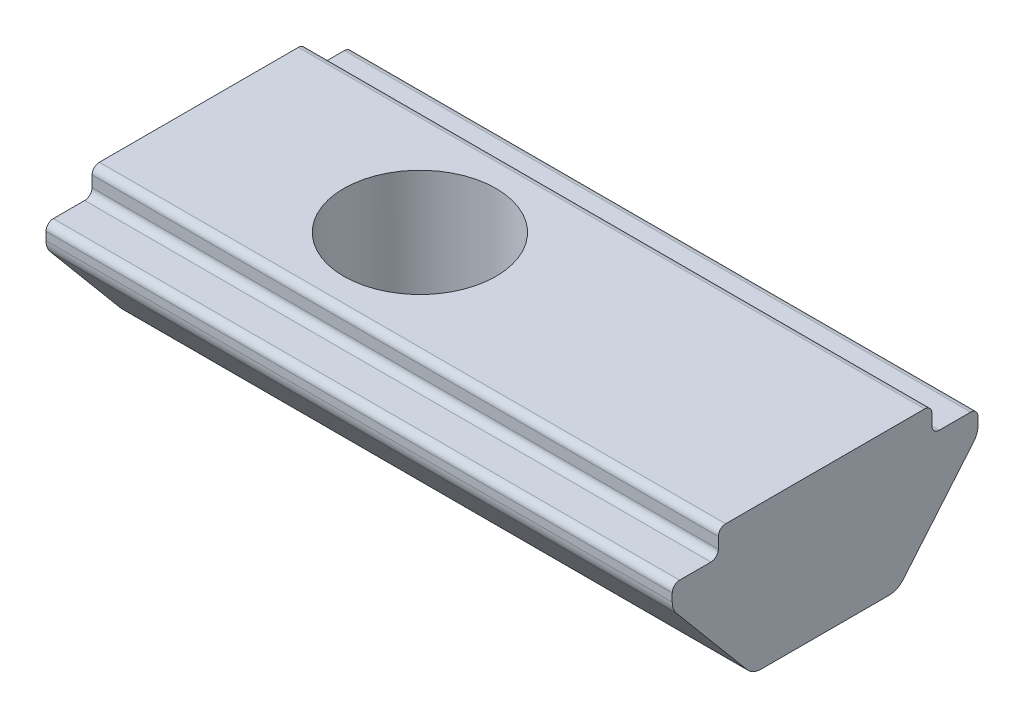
ISO-10303-21;
HEADER;
FILE_DESCRIPTION(('STEP AP214'),'2;1');
FILE_NAME('part.step','',(''),(''),'','','');
FILE_SCHEMA(('AUTOMOTIVE_DESIGN { 1 0 10303 214 1 1 1 1 }'));
ENDSEC;
DATA;
#1=APPLICATION_CONTEXT('core data for automotive mechanical design processes');
#2=APPLICATION_PROTOCOL_DEFINITION('international standard','automotive_design',2000,#1);
#3=PRODUCT_CONTEXT('',#1,'mechanical');
#4=PRODUCT('Part','Part','',(#3));
#5=PRODUCT_RELATED_PRODUCT_CATEGORY('part','',(#4));
#6=PRODUCT_DEFINITION_FORMATION('','',#4);
#7=PRODUCT_DEFINITION_CONTEXT('part definition',#1,'design');
#8=PRODUCT_DEFINITION('design','',#6,#7);
#9=PRODUCT_DEFINITION_SHAPE('','',#8);
#10=(LENGTH_UNIT() NAMED_UNIT(*) SI_UNIT(.MILLI.,.METRE.));
#11=(NAMED_UNIT(*) PLANE_ANGLE_UNIT() SI_UNIT($,.RADIAN.));
#12=(NAMED_UNIT(*) SI_UNIT($,.STERADIAN.) SOLID_ANGLE_UNIT());
#13=UNCERTAINTY_MEASURE_WITH_UNIT(LENGTH_MEASURE(1.E-05),#10,'distance_accuracy_value','');
#14=(GEOMETRIC_REPRESENTATION_CONTEXT(3) GLOBAL_UNCERTAINTY_ASSIGNED_CONTEXT((#13)) GLOBAL_UNIT_ASSIGNED_CONTEXT((#10,
#11,#12)) REPRESENTATION_CONTEXT('',''));
#15=CARTESIAN_POINT('',(0.,0.,0.));
#16=DIRECTION('',(0.,0.,1.));
#17=DIRECTION('',(1.,0.,0.));
#18=AXIS2_PLACEMENT_3D('',#15,#16,#17);
#19=CARTESIAN_POINT('',(11.,-3.2,1.96834095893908));
#20=DIRECTION('',(0.,1.,0.));
#21=DIRECTION('',(0.,0.,1.));
#22=AXIS2_PLACEMENT_3D('',#19,#20,#21);
#23=PLANE('',#22);
#24=DIRECTION('',(-1.,0.,0.));
#25=VECTOR('',#24,1.);
#26=CARTESIAN_POINT('',(11.,-3.2,1.73518712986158));
#27=LINE('',#26,#25);
#28=CARTESIAN_POINT('',(6.27278727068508,-3.2,1.73518712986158));
#29=VERTEX_POINT('',#28);
#30=CARTESIAN_POINT('',(1.12321619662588,-3.2,1.73518712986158));
#31=VERTEX_POINT('',#30);
#32=EDGE_CURVE('E232',#29,#31,#27,.T.);
#33=ORIENTED_EDGE('',*,*,#32,.T.);
#34=CARTESIAN_POINT('',(0.,-3.2,0.));
#35=DIRECTION('',(0.,1.,0.));
#36=DIRECTION('',(0.,0.,1.));
#37=AXIS2_PLACEMENT_3D('',#34,#35,#36);
#38=CIRCLE('',#37,2.06699999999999);
#39=CARTESIAN_POINT('',(1.12321619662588,-3.2,-1.73518712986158));
#40=VERTEX_POINT('',#39);
#41=EDGE_CURVE('E56',#31,#40,#38,.T.);
#42=ORIENTED_EDGE('',*,*,#41,.T.);
#43=DIRECTION('',(-1.,0.,0.));
#44=VECTOR('',#43,1.);
#45=CARTESIAN_POINT('',(11.,-3.2,-1.73518712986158));
#46=LINE('',#45,#44);
#47=CARTESIAN_POINT('',(6.27278727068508,-3.2,-1.73518712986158));
#48=VERTEX_POINT('',#47);
#49=EDGE_CURVE('E80',#40,#48,#46,.F.);
#50=ORIENTED_EDGE('',*,*,#49,.T.);
#51=CARTESIAN_POINT('',(6.5,-3.2,0.));
#52=DIRECTION('',(0.,1.,0.));
#53=DIRECTION('',(0.,0.,1.));
#54=AXIS2_PLACEMENT_3D('',#51,#52,#53);
#55=CIRCLE('',#54,1.75);
#56=EDGE_CURVE('E380',#48,#29,#55,.T.);
#57=ORIENTED_EDGE('',*,*,#56,.T.);
#58=EDGE_LOOP('',(#33,#42,#50,#57));
#59=FACE_BOUND('',#58,.T.);
#60=ADVANCED_FACE('F36',(#59),#23,.F.);
#61=CARTESIAN_POINT('',(-6.,-3.2,-1.73518712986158));
#62=VERTEX_POINT('',#61);
#63=CARTESIAN_POINT('',(-1.12321619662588,-3.2,-1.73518712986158));
#64=VERTEX_POINT('',#63);
#65=EDGE_CURVE('E236',#62,#64,#46,.F.);
#66=ORIENTED_EDGE('',*,*,#65,.T.);
#67=CARTESIAN_POINT('',(-1.12321619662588,-3.2,1.73518712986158));
#68=VERTEX_POINT('',#67);
#69=EDGE_CURVE('E390',#64,#68,#38,.T.);
#70=ORIENTED_EDGE('',*,*,#69,.T.);
#71=CARTESIAN_POINT('',(-6.,-3.2,1.73518712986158));
#72=VERTEX_POINT('',#71);
#73=EDGE_CURVE('E234',#68,#72,#27,.T.);
#74=ORIENTED_EDGE('',*,*,#73,.T.);
#75=DIRECTION('',(0.,0.,-1.));
#76=VECTOR('',#75,1.);
#77=CARTESIAN_POINT('',(-6.,-3.2,1.96834095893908));
#78=LINE('',#77,#76);
#79=EDGE_CURVE('E352',#72,#62,#78,.T.);
#80=ORIENTED_EDGE('',*,*,#79,.T.);
#81=EDGE_LOOP('',(#66,#70,#74,#80));
#82=FACE_BOUND('',#81,.T.);
#83=ADVANCED_FACE('F430',(#82),#23,.F.);
#84=CARTESIAN_POINT('',(6.72721272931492,-3.2,1.73518712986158));
#85=VERTEX_POINT('',#84);
#86=CARTESIAN_POINT('',(6.72721272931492,-3.2,-1.73518712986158));
#87=VERTEX_POINT('',#86);
#88=EDGE_CURVE('E65',#85,#87,#55,.T.);
#89=ORIENTED_EDGE('',*,*,#88,.T.);
#90=CARTESIAN_POINT('',(11.,-3.2,-1.73518712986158));
#91=VERTEX_POINT('',#90);
#92=EDGE_CURVE('E228',#87,#91,#46,.F.);
#93=ORIENTED_EDGE('',*,*,#92,.T.);
#94=DIRECTION('',(0.,0.,-1.));
#95=VECTOR('',#94,1.);
#96=CARTESIAN_POINT('',(11.,-3.2,1.96834095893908));
#97=LINE('',#96,#95);
#98=CARTESIAN_POINT('',(11.,-3.2,1.73518712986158));
#99=VERTEX_POINT('',#98);
#100=EDGE_CURVE('E213',#99,#91,#97,.T.);
#101=ORIENTED_EDGE('',*,*,#100,.F.);
#102=EDGE_CURVE('E226',#99,#85,#27,.T.);
#103=ORIENTED_EDGE('',*,*,#102,.T.);
#104=EDGE_LOOP('',(#89,#93,#101,#103));
#105=FACE_BOUND('',#104,.T.);
#106=ADVANCED_FACE('F225',(#105),#23,.F.);
#107=CARTESIAN_POINT('',(11.,-2.7,-1.73518712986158));
#108=DIRECTION('',(-1.,0.,0.));
#109=DIRECTION('',(0.,0.,1.));
#110=AXIS2_PLACEMENT_3D('',#107,#108,#109);
#111=CYLINDRICAL_SURFACE('',#110,0.5);
#112=CARTESIAN_POINT('',(-1.12321619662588,-3.2,-1.73518712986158));
#113=CARTESIAN_POINT('',(-1.08769534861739,-3.19997959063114,-1.75818499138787));
#114=CARTESIAN_POINT('',(-1.05150737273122,-3.19841594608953,-1.78005784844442));
#115=CARTESIAN_POINT('',(-0.978056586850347,-3.19294935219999,-1.82144547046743));
#116=CARTESIAN_POINT('',(-0.940795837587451,-3.18905063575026,-1.84096442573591));
#117=CARTESIAN_POINT('',(-0.865132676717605,-3.17963116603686,-1.87771521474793));
#118=CARTESIAN_POINT('',(-0.826725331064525,-3.17410207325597,-1.89493461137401));
#119=CARTESIAN_POINT('',(-0.74905599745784,-3.16207862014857,-1.92695879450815));
#120=CARTESIAN_POINT('',(-0.709793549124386,-3.15558372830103,-1.94176224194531));
#121=CARTESIAN_POINT('',(-0.57912834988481,-3.13361926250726,-1.98654275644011));
#122=CARTESIAN_POINT('',(-0.485988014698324,-3.1174100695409,-2.01137196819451));
#123=CARTESIAN_POINT('',(-0.344114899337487,-3.09748613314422,-2.03871928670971));
#124=CARTESIAN_POINT('',(-0.296590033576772,-3.09158617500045,-2.04617896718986));
#125=CARTESIAN_POINT('',(-0.20091774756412,-3.08209086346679,-2.05777546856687));
#126=CARTESIAN_POINT('',(-0.152770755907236,-3.07849400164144,-2.06191446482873));
#127=CARTESIAN_POINT('',(-0.0503369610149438,-3.07396696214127,-2.06709713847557));
#128=CARTESIAN_POINT('',(0.00398999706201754,-3.0734107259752,-2.0677072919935));
#129=CARTESIAN_POINT('',(0.112431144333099,-3.07610538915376,-2.06465306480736));
#130=CARTESIAN_POINT('',(0.166545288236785,-3.07935705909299,-2.06098781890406));
#131=CARTESIAN_POINT('',(0.274452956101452,-3.08898741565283,-2.04942295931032));
#132=CARTESIAN_POINT('',(0.32824057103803,-3.09539059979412,-2.04149012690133));
#133=CARTESIAN_POINT('',(0.434781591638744,-3.11010689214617,-2.02148331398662));
#134=CARTESIAN_POINT('',(0.487534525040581,-3.11842085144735,-2.00940748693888));
#135=CARTESIAN_POINT('',(0.591294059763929,-3.13551659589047,-1.98134246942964));
#136=CARTESIAN_POINT('',(0.642313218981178,-3.1442925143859,-1.96539594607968));
#137=CARTESIAN_POINT('',(0.743032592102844,-3.16109163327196,-1.9295717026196));
#138=CARTESIAN_POINT('',(0.792733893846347,-3.16911546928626,-1.90969734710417));
#139=CARTESIAN_POINT('',(0.890201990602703,-3.18305719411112,-1.86623740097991));
#140=CARTESIAN_POINT('',(0.93798343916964,-3.1889959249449,-1.8426921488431));
#141=CARTESIAN_POINT('',(1.03193471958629,-3.19744832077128,-1.79177872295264));
#142=CARTESIAN_POINT('',(1.07809968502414,-3.19995238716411,-1.76440007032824));
#143=CARTESIAN_POINT('',(1.12321619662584,-3.20000000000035,-1.73518712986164));
#144=B_SPLINE_CURVE_WITH_KNOTS('',3,(#112,#113,#114,#115,#116,#117,#118,#119,#120,#121,#122,
#123,#124,#125,#126,#127,#128,#129,#130,#131,#132,#133,#134,#135,#136,#137,#138,#139,#140,#141,
#142,#143),.UNSPECIFIED.,.F.,.F.,(4,2,2,2,2,2,2,2,2,2,2,2,2,2,2,4),(0.,0.126826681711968,
0.253424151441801,0.3806807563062,0.508007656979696,0.800068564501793,0.945343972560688,
1.09052413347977,1.25321406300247,1.41593692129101,1.57994513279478,1.74402653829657,
1.90637542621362,2.06858584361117,2.22912532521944,2.39011254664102),.UNSPECIFIED.);
#145=EDGE_CURVE('E384',#64,#40,#144,.T.);
#146=ORIENTED_EDGE('',*,*,#145,.F.);
#147=ORIENTED_EDGE('',*,*,#65,.F.);
#148=CARTESIAN_POINT('',(-6.,-2.7,-1.73518712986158));
#149=DIRECTION('',(1.,0.,0.));
#150=DIRECTION('',(0.,0.,-1.));
#151=AXIS2_PLACEMENT_3D('',#148,#149,#150);
#152=CIRCLE('',#151,0.5);
#153=CARTESIAN_POINT('',(-6.,-3.02139380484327,-2.11820935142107));
#154=VERTEX_POINT('',#153);
#155=EDGE_CURVE('E269',#154,#62,#152,.F.);
#156=ORIENTED_EDGE('',*,*,#155,.F.);
#157=DIRECTION('',(-1.,0.,0.));
#158=VECTOR('',#157,1.);
#159=CARTESIAN_POINT('',(11.,-3.02139380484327,-2.11820935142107));
#160=LINE('',#159,#158);
#161=CARTESIAN_POINT('',(11.,-3.02139380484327,-2.11820935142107));
#162=VERTEX_POINT('',#161);
#163=EDGE_CURVE('E262',#162,#154,#160,.T.);
#164=ORIENTED_EDGE('',*,*,#163,.F.);
#165=CARTESIAN_POINT('',(11.,-2.7,-1.73518712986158));
#166=DIRECTION('',(1.,0.,0.));
#167=DIRECTION('',(0.,0.,-1.));
#168=AXIS2_PLACEMENT_3D('',#165,#166,#167);
#169=CIRCLE('',#168,0.5);
#170=EDGE_CURVE('E220',#91,#162,#169,.T.);
#171=ORIENTED_EDGE('',*,*,#170,.F.);
#172=ORIENTED_EDGE('',*,*,#92,.F.);
#173=CARTESIAN_POINT('',(6.72721272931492,-3.2,-1.73518712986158));
#174=CARTESIAN_POINT('',(6.68947863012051,-3.19998176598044,-1.74012995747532));
#175=CARTESIAN_POINT('',(6.65158311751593,-3.19992670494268,-1.74383840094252));
#176=CARTESIAN_POINT('',(6.57579128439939,-3.19982610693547,-1.7487682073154));
#177=CARTESIAN_POINT('',(6.53789564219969,-3.19978053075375,-1.75));
#178=CARTESIAN_POINT('',(6.46210435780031,-3.19978053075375,-1.75));
#179=CARTESIAN_POINT('',(6.42420871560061,-3.19982610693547,-1.7487682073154));
#180=CARTESIAN_POINT('',(6.34841688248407,-3.19992670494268,-1.74383840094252));
#181=CARTESIAN_POINT('',(6.31052136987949,-3.19998176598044,-1.74012995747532));
#182=CARTESIAN_POINT('',(6.27278727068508,-3.2,-1.73518712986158));
#183=B_SPLINE_CURVE_WITH_KNOTS('',3,(#173,#174,#175,#176,#177,#178,#179,#180,#181,#182),
.UNSPECIFIED.,.F.,.F.,(4,2,2,2,4),(0.,0.114148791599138,0.227815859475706,0.341482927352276,
0.455631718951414),.UNSPECIFIED.);
#184=EDGE_CURVE('E359',#87,#48,#183,.T.);
#185=ORIENTED_EDGE('',*,*,#184,.T.);
#186=ORIENTED_EDGE('',*,*,#49,.F.);
#187=EDGE_LOOP('',(#146,#147,#156,#164,#171,#172,#185,#186));
#188=FACE_BOUND('',#187,.T.);
#189=ADVANCED_FACE('F392',(#188),#111,.T.);
#190=CARTESIAN_POINT('',(11.,-2.7,1.73518712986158));
#191=DIRECTION('',(-1.,0.,0.));
#192=DIRECTION('',(0.,0.,1.));
#193=AXIS2_PLACEMENT_3D('',#190,#191,#192);
#194=CYLINDRICAL_SURFACE('',#193,0.5);
#195=CARTESIAN_POINT('',(1.12321619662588,-3.2,1.73518712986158));
#196=CARTESIAN_POINT('',(1.08769534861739,-3.19997959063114,1.75818499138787));
#197=CARTESIAN_POINT('',(1.05150737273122,-3.19841594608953,1.78005784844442));
#198=CARTESIAN_POINT('',(0.978056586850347,-3.19294935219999,1.82144547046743));
#199=CARTESIAN_POINT('',(0.940795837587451,-3.18905063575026,1.84096442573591));
#200=CARTESIAN_POINT('',(0.865132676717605,-3.17963116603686,1.87771521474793));
#201=CARTESIAN_POINT('',(0.826725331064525,-3.17410207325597,1.89493461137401));
#202=CARTESIAN_POINT('',(0.74905599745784,-3.16207862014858,1.92695879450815));
#203=CARTESIAN_POINT('',(0.709793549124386,-3.15558372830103,1.94176224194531));
#204=CARTESIAN_POINT('',(0.579128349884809,-3.13361926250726,1.9865427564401));
#205=CARTESIAN_POINT('',(0.485988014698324,-3.1174100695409,2.01137196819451));
#206=CARTESIAN_POINT('',(0.344114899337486,-3.09748613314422,2.03871928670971));
#207=CARTESIAN_POINT('',(0.296590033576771,-3.09158617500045,2.04617896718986));
#208=CARTESIAN_POINT('',(0.200917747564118,-3.08209086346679,2.05777546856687));
#209=CARTESIAN_POINT('',(0.152770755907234,-3.07849400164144,2.06191446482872));
#210=CARTESIAN_POINT('',(0.0503369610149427,-3.07396696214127,2.06709713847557));
#211=CARTESIAN_POINT('',(-0.00398999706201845,-3.0734107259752,2.0677072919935));
#212=CARTESIAN_POINT('',(-0.1124311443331,-3.07610538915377,2.06465306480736));
#213=CARTESIAN_POINT('',(-0.166545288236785,-3.07935705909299,2.06098781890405));
#214=CARTESIAN_POINT('',(-0.274452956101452,-3.08898741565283,2.04942295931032));
#215=CARTESIAN_POINT('',(-0.328240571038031,-3.09539059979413,2.04149012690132));
#216=CARTESIAN_POINT('',(-0.434781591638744,-3.11010689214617,2.02148331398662));
#217=CARTESIAN_POINT('',(-0.487534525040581,-3.11842085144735,2.00940748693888));
#218=CARTESIAN_POINT('',(-0.591294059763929,-3.13551659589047,1.98134246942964));
#219=CARTESIAN_POINT('',(-0.642313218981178,-3.1442925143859,1.96539594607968));
#220=CARTESIAN_POINT('',(-0.743032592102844,-3.16109163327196,1.92957170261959));
#221=CARTESIAN_POINT('',(-0.792733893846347,-3.16911546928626,1.90969734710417));
#222=CARTESIAN_POINT('',(-0.890201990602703,-3.18305719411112,1.86623740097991));
#223=CARTESIAN_POINT('',(-0.93798343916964,-3.1889959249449,1.84269214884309));
#224=CARTESIAN_POINT('',(-1.03193471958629,-3.19744832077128,1.79177872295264));
#225=CARTESIAN_POINT('',(-1.07809968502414,-3.19995238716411,1.76440007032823));
#226=CARTESIAN_POINT('',(-1.12321619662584,-3.20000000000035,1.73518712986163));
#227=B_SPLINE_CURVE_WITH_KNOTS('',3,(#195,#196,#197,#198,#199,#200,#201,#202,#203,#204,#205,
#206,#207,#208,#209,#210,#211,#212,#213,#214,#215,#216,#217,#218,#219,#220,#221,#222,#223,#224,
#225,#226),.UNSPECIFIED.,.F.,.F.,(4,2,2,2,2,2,2,2,2,2,2,2,2,2,2,4),(0.,0.126826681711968,
0.253424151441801,0.380680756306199,0.508007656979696,0.800068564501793,0.945343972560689,
1.09052413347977,1.25321406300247,1.41593692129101,1.57994513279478,1.74402653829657,
1.90637542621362,2.06858584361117,2.22912532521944,2.39011254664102),.UNSPECIFIED.);
#228=EDGE_CURVE('E11',#31,#68,#227,.T.);
#229=ORIENTED_EDGE('',*,*,#228,.F.);
#230=ORIENTED_EDGE('',*,*,#32,.F.);
#231=CARTESIAN_POINT('',(6.27278727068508,-3.2,1.73518712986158));
#232=CARTESIAN_POINT('',(6.31052136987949,-3.19998176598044,1.74012995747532));
#233=CARTESIAN_POINT('',(6.34841688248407,-3.19992670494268,1.74383840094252));
#234=CARTESIAN_POINT('',(6.42420871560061,-3.19982610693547,1.7487682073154));
#235=CARTESIAN_POINT('',(6.46210435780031,-3.19978053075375,1.75));
#236=CARTESIAN_POINT('',(6.53789564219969,-3.19978053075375,1.75));
#237=CARTESIAN_POINT('',(6.57579128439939,-3.19982610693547,1.7487682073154));
#238=CARTESIAN_POINT('',(6.65158311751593,-3.19992670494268,1.74383840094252));
#239=CARTESIAN_POINT('',(6.68947863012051,-3.19998176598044,1.74012995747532));
#240=CARTESIAN_POINT('',(6.72721272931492,-3.2,1.73518712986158));
#241=B_SPLINE_CURVE_WITH_KNOTS('',3,(#231,#232,#233,#234,#235,#236,#237,#238,#239,#240),
.UNSPECIFIED.,.F.,.F.,(4,2,2,2,4),(0.,0.11414879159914,0.227815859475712,0.341482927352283,
0.455631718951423),.UNSPECIFIED.);
#242=EDGE_CURVE('E50',#29,#85,#241,.T.);
#243=ORIENTED_EDGE('',*,*,#242,.T.);
#244=ORIENTED_EDGE('',*,*,#102,.F.);
#245=CARTESIAN_POINT('',(11.,-2.7,1.73518712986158));
#246=DIRECTION('',(1.,0.,0.));
#247=DIRECTION('',(0.,0.,-1.));
#248=AXIS2_PLACEMENT_3D('',#245,#246,#247);
#249=CIRCLE('',#248,0.5);
#250=CARTESIAN_POINT('',(11.,-3.02139380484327,2.11820935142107));
#251=VERTEX_POINT('',#250);
#252=EDGE_CURVE('E209',#251,#99,#249,.T.);
#253=ORIENTED_EDGE('',*,*,#252,.F.);
#254=DIRECTION('',(-1.,0.,0.));
#255=VECTOR('',#254,1.);
#256=CARTESIAN_POINT('',(11.,-3.02139380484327,2.11820935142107));
#257=LINE('',#256,#255);
#258=CARTESIAN_POINT('',(-6.,-3.02139380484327,2.11820935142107));
#259=VERTEX_POINT('',#258);
#260=EDGE_CURVE('E252',#259,#251,#257,.F.);
#261=ORIENTED_EDGE('',*,*,#260,.F.);
#262=CARTESIAN_POINT('',(-6.,-2.7,1.73518712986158));
#263=DIRECTION('',(1.,0.,0.));
#264=DIRECTION('',(0.,0.,-1.));
#265=AXIS2_PLACEMENT_3D('',#262,#263,#264);
#266=CIRCLE('',#265,0.5);
#267=EDGE_CURVE('E271',#72,#259,#266,.F.);
#268=ORIENTED_EDGE('',*,*,#267,.F.);
#269=ORIENTED_EDGE('',*,*,#73,.F.);
#270=EDGE_LOOP('',(#229,#230,#243,#244,#253,#261,#268,#269));
#271=FACE_BOUND('',#270,.T.);
#272=ADVANCED_FACE('F38',(#271),#194,.T.);
#273=CARTESIAN_POINT('',(11.,0.,4.15));
#274=DIRECTION('',(0.,0.,-1.));
#275=DIRECTION('',(-1.,0.,0.));
#276=AXIS2_PLACEMENT_3D('',#273,#274,#275);
#277=PLANE('',#276);
#278=DIRECTION('',(0.,-1.,0.));
#279=VECTOR('',#278,1.);
#280=CARTESIAN_POINT('',(-6.,0.,4.15));
#281=LINE('',#280,#279);
#282=CARTESIAN_POINT('',(-6.,-0.200000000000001,4.15));
#283=VERTEX_POINT('',#282);
#284=CARTESIAN_POINT('',(-6.,-0.4180148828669,4.15));
#285=VERTEX_POINT('',#284);
#286=EDGE_CURVE('E357',#283,#285,#281,.T.);
#287=ORIENTED_EDGE('',*,*,#286,.T.);
#288=DIRECTION('',(-1.,0.,0.));
#289=VECTOR('',#288,1.);
#290=CARTESIAN_POINT('',(11.,-0.4180148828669,4.15));
#291=LINE('',#290,#289);
#292=CARTESIAN_POINT('',(11.,-0.4180148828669,4.15));
#293=VERTEX_POINT('',#292);
#294=EDGE_CURVE('E239',#285,#293,#291,.F.);
#295=ORIENTED_EDGE('',*,*,#294,.T.);
#296=DIRECTION('',(0.,-1.,0.));
#297=VECTOR('',#296,1.);
#298=CARTESIAN_POINT('',(11.,0.,4.15));
#299=LINE('',#298,#297);
#300=CARTESIAN_POINT('',(11.,-0.200000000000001,4.15));
#301=VERTEX_POINT('',#300);
#302=EDGE_CURVE('E334',#301,#293,#299,.T.);
#303=ORIENTED_EDGE('',*,*,#302,.F.);
#304=DIRECTION('',(-1.,0.,0.));
#305=VECTOR('',#304,1.);
#306=CARTESIAN_POINT('',(11.,-0.200000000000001,4.15));
#307=LINE('',#306,#305);
#308=EDGE_CURVE('E284',#301,#283,#307,.T.);
#309=ORIENTED_EDGE('',*,*,#308,.T.);
#310=EDGE_LOOP('',(#287,#295,#303,#309));
#311=FACE_BOUND('',#310,.T.);
#312=ADVANCED_FACE('F489',(#311),#277,.F.);
#313=CARTESIAN_POINT('',(11.,-0.600000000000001,4.15));
#314=DIRECTION('',(0.,0.642787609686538,-0.766044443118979));
#315=DIRECTION('',(0.,0.766044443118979,0.642787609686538));
#316=AXIS2_PLACEMENT_3D('',#313,#314,#315);
#317=PLANE('',#316);
#318=DIRECTION('',(0.,-0.766044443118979,-0.642787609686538));
#319=VECTOR('',#318,1.);
#320=CARTESIAN_POINT('',(11.,-0.600000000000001,4.15));
#321=LINE('',#320,#319);
#322=CARTESIAN_POINT('',(11.,-0.739408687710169,4.03302222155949));
#323=VERTEX_POINT('',#322);
#324=EDGE_CURVE('E216',#323,#251,#321,.T.);
#325=ORIENTED_EDGE('',*,*,#324,.F.);
#326=DIRECTION('',(-1.,0.,0.));
#327=VECTOR('',#326,1.);
#328=CARTESIAN_POINT('',(11.,-0.739408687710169,4.03302222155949));
#329=LINE('',#328,#327);
#330=CARTESIAN_POINT('',(-6.,-0.739408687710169,4.03302222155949));
#331=VERTEX_POINT('',#330);
#332=EDGE_CURVE('E245',#323,#331,#329,.T.);
#333=ORIENTED_EDGE('',*,*,#332,.T.);
#334=DIRECTION('',(0.,-0.766044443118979,-0.642787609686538));
#335=VECTOR('',#334,1.);
#336=CARTESIAN_POINT('',(-6.,-0.600000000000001,4.15));
#337=LINE('',#336,#335);
#338=EDGE_CURVE('E354',#331,#259,#337,.T.);
#339=ORIENTED_EDGE('',*,*,#338,.T.);
#340=ORIENTED_EDGE('',*,*,#260,.T.);
#341=EDGE_LOOP('',(#325,#333,#339,#340));
#342=FACE_BOUND('',#341,.T.);
#343=ADVANCED_FACE('F484',(#342),#317,.F.);
#344=CARTESIAN_POINT('',(11.,-3.2,-1.96834095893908));
#345=DIRECTION('',(0.,0.642787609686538,0.766044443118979));
#346=DIRECTION('',(0.,-0.766044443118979,0.642787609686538));
#347=AXIS2_PLACEMENT_3D('',#344,#345,#346);
#348=PLANE('',#347);
#349=DIRECTION('',(0.,0.766044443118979,-0.642787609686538));
#350=VECTOR('',#349,1.);
#351=CARTESIAN_POINT('',(-6.,-3.2,-1.96834095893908));
#352=LINE('',#351,#350);
#353=CARTESIAN_POINT('',(-6.,-0.739408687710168,-4.03302222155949));
#354=VERTEX_POINT('',#353);
#355=EDGE_CURVE('E349',#154,#354,#352,.T.);
#356=ORIENTED_EDGE('',*,*,#355,.T.);
#357=DIRECTION('',(-1.,0.,0.));
#358=VECTOR('',#357,1.);
#359=CARTESIAN_POINT('',(11.,-0.739408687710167,-4.03302222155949));
#360=LINE('',#359,#358);
#361=CARTESIAN_POINT('',(11.,-0.739408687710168,-4.03302222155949));
#362=VERTEX_POINT('',#361);
#363=EDGE_CURVE('E221',#354,#362,#360,.F.);
#364=ORIENTED_EDGE('',*,*,#363,.T.);
#365=DIRECTION('',(0.,0.766044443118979,-0.642787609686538));
#366=VECTOR('',#365,1.);
#367=CARTESIAN_POINT('',(11.,-3.2,-1.96834095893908));
#368=LINE('',#367,#366);
#369=EDGE_CURVE('E229',#162,#362,#368,.T.);
#370=ORIENTED_EDGE('',*,*,#369,.F.);
#371=ORIENTED_EDGE('',*,*,#163,.T.);
#372=EDGE_LOOP('',(#356,#364,#370,#371));
#373=FACE_BOUND('',#372,.T.);
#374=ADVANCED_FACE('F479',(#373),#348,.F.);
#375=CARTESIAN_POINT('',(11.,-0.6,-4.15));
#376=DIRECTION('',(0.,0.,1.));
#377=DIRECTION('',(1.,0.,0.));
#378=AXIS2_PLACEMENT_3D('',#375,#376,#377);
#379=PLANE('',#378);
#380=DIRECTION('',(0.,1.,0.));
#381=VECTOR('',#380,1.);
#382=CARTESIAN_POINT('',(11.,-0.6,-4.15));
#383=LINE('',#382,#381);
#384=CARTESIAN_POINT('',(11.,-0.418014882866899,-4.15));
#385=VERTEX_POINT('',#384);
#386=CARTESIAN_POINT('',(11.,-0.2,-4.15));
#387=VERTEX_POINT('',#386);
#388=EDGE_CURVE('E374',#385,#387,#383,.T.);
#389=ORIENTED_EDGE('',*,*,#388,.F.);
#390=DIRECTION('',(-1.,0.,0.));
#391=VECTOR('',#390,1.);
#392=CARTESIAN_POINT('',(11.,-0.418014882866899,-4.15));
#393=LINE('',#392,#391);
#394=CARTESIAN_POINT('',(-6.,-0.418014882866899,-4.15));
#395=VERTEX_POINT('',#394);
#396=EDGE_CURVE('E273',#385,#395,#393,.T.);
#397=ORIENTED_EDGE('',*,*,#396,.T.);
#398=DIRECTION('',(0.,1.,0.));
#399=VECTOR('',#398,1.);
#400=CARTESIAN_POINT('',(-6.,-0.6,-4.15));
#401=LINE('',#400,#399);
#402=CARTESIAN_POINT('',(-6.,-0.2,-4.15));
#403=VERTEX_POINT('',#402);
#404=EDGE_CURVE('E347',#395,#403,#401,.T.);
#405=ORIENTED_EDGE('',*,*,#404,.T.);
#406=DIRECTION('',(-1.,0.,0.));
#407=VECTOR('',#406,1.);
#408=CARTESIAN_POINT('',(11.,-0.2,-4.15));
#409=LINE('',#408,#407);
#410=EDGE_CURVE('E287',#403,#387,#409,.F.);
#411=ORIENTED_EDGE('',*,*,#410,.T.);
#412=EDGE_LOOP('',(#389,#397,#405,#411));
#413=FACE_BOUND('',#412,.T.);
#414=ADVANCED_FACE('F471',(#413),#379,.F.);
#415=CARTESIAN_POINT('',(11.,0.,-4.15));
#416=DIRECTION('',(0.,-1.,0.));
#417=DIRECTION('',(0.,0.,-1.));
#418=AXIS2_PLACEMENT_3D('',#415,#416,#417);
#419=PLANE('',#418);
#420=DIRECTION('',(0.,0.,1.));
#421=VECTOR('',#420,1.);
#422=CARTESIAN_POINT('',(-6.,0.,-4.15));
#423=LINE('',#422,#421);
#424=CARTESIAN_POINT('',(-6.,0.,-3.95));
#425=VERTEX_POINT('',#424);
#426=CARTESIAN_POINT('',(-6.,0.,-3.1));
#427=VERTEX_POINT('',#426);
#428=EDGE_CURVE('E344',#425,#427,#423,.T.);
#429=ORIENTED_EDGE('',*,*,#428,.T.);
#430=DIRECTION('',(-1.,0.,0.));
#431=VECTOR('',#430,1.);
#432=CARTESIAN_POINT('',(11.,0.,-3.1));
#433=LINE('',#432,#431);
#434=CARTESIAN_POINT('',(11.,0.,-3.1));
#435=VERTEX_POINT('',#434);
#436=EDGE_CURVE('E295',#427,#435,#433,.F.);
#437=ORIENTED_EDGE('',*,*,#436,.T.);
#438=DIRECTION('',(0.,0.,1.));
#439=VECTOR('',#438,1.);
#440=CARTESIAN_POINT('',(11.,0.,-4.15));
#441=LINE('',#440,#439);
#442=CARTESIAN_POINT('',(11.,0.,-3.95));
#443=VERTEX_POINT('',#442);
#444=EDGE_CURVE('E371',#443,#435,#441,.T.);
#445=ORIENTED_EDGE('',*,*,#444,.F.);
#446=DIRECTION('',(-1.,0.,0.));
#447=VECTOR('',#446,1.);
#448=CARTESIAN_POINT('',(11.,0.,-3.95));
#449=LINE('',#448,#447);
#450=EDGE_CURVE('E297',#443,#425,#449,.T.);
#451=ORIENTED_EDGE('',*,*,#450,.T.);
#452=EDGE_LOOP('',(#429,#437,#445,#451));
#453=FACE_BOUND('',#452,.T.);
#454=ADVANCED_FACE('F461',(#453),#419,.F.);
#455=CARTESIAN_POINT('',(11.,0.,-2.9));
#456=DIRECTION('',(0.,0.,1.));
#457=DIRECTION('',(0.,-1.,0.));
#458=AXIS2_PLACEMENT_3D('',#455,#456,#457);
#459=PLANE('',#458);
#460=DIRECTION('',(0.,1.,0.));
#461=VECTOR('',#460,1.);
#462=CARTESIAN_POINT('',(-6.,0.,-2.9));
#463=LINE('',#462,#461);
#464=CARTESIAN_POINT('',(-6.,0.2,-2.9));
#465=VERTEX_POINT('',#464);
#466=CARTESIAN_POINT('',(-6.,0.499999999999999,-2.9));
#467=VERTEX_POINT('',#466);
#468=EDGE_CURVE('E341',#465,#467,#463,.T.);
#469=ORIENTED_EDGE('',*,*,#468,.T.);
#470=DIRECTION('',(-1.,0.,0.));
#471=VECTOR('',#470,1.);
#472=CARTESIAN_POINT('',(11.,0.499999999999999,-2.9));
#473=LINE('',#472,#471);
#474=CARTESIAN_POINT('',(11.,0.499999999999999,-2.9));
#475=VERTEX_POINT('',#474);
#476=EDGE_CURVE('E313',#467,#475,#473,.F.);
#477=ORIENTED_EDGE('',*,*,#476,.T.);
#478=DIRECTION('',(0.,1.,0.));
#479=VECTOR('',#478,1.);
#480=CARTESIAN_POINT('',(11.,0.,-2.9));
#481=LINE('',#480,#479);
#482=CARTESIAN_POINT('',(11.,0.2,-2.9));
#483=VERTEX_POINT('',#482);
#484=EDGE_CURVE('E368',#483,#475,#481,.T.);
#485=ORIENTED_EDGE('',*,*,#484,.F.);
#486=DIRECTION('',(-1.,0.,0.));
#487=VECTOR('',#486,1.);
#488=CARTESIAN_POINT('',(-6.,0.2,-2.9));
#489=LINE('',#488,#487);
#490=EDGE_CURVE('E315',#483,#465,#489,.T.);
#491=ORIENTED_EDGE('',*,*,#490,.T.);
#492=EDGE_LOOP('',(#469,#477,#485,#491));
#493=FACE_BOUND('',#492,.T.);
#494=ADVANCED_FACE('F440',(#493),#459,.F.);
#495=CARTESIAN_POINT('',(11.,0.699999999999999,-2.9));
#496=DIRECTION('',(0.,-1.,0.));
#497=DIRECTION('',(0.,0.,-1.));
#498=AXIS2_PLACEMENT_3D('',#495,#496,#497);
#499=PLANE('',#498);
#500=CARTESIAN_POINT('',(0.,0.7,0.));
#501=DIRECTION('',(0.,1.,0.));
#502=DIRECTION('',(0.,0.,1.));
#503=AXIS2_PLACEMENT_3D('',#500,#501,#502);
#504=CIRCLE('',#503,2.06699999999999);
#505=CARTESIAN_POINT('',(0.,0.7,2.06699999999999));
#506=VERTEX_POINT('',#505);
#507=EDGE_CURVE('E432',#506,#506,#504,.T.);
#508=ORIENTED_EDGE('',*,*,#507,.F.);
#509=EDGE_LOOP('',(#508));
#510=FACE_BOUND('',#509,.T.);
#511=DIRECTION('',(0.,0.,1.));
#512=VECTOR('',#511,1.);
#513=CARTESIAN_POINT('',(11.,0.699999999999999,-2.9));
#514=LINE('',#513,#512);
#515=CARTESIAN_POINT('',(11.,0.699999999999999,-2.7));
#516=VERTEX_POINT('',#515);
#517=CARTESIAN_POINT('',(11.,0.699999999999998,2.7));
#518=VERTEX_POINT('',#517);
#519=EDGE_CURVE('E365',#516,#518,#514,.T.);
#520=ORIENTED_EDGE('',*,*,#519,.F.);
#521=DIRECTION('',(-1.,0.,0.));
#522=VECTOR('',#521,1.);
#523=CARTESIAN_POINT('',(11.,0.699999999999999,-2.7));
#524=LINE('',#523,#522);
#525=CARTESIAN_POINT('',(-6.,0.699999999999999,-2.7));
#526=VERTEX_POINT('',#525);
#527=EDGE_CURVE('E326',#516,#526,#524,.T.);
#528=ORIENTED_EDGE('',*,*,#527,.T.);
#529=DIRECTION('',(0.,0.,1.));
#530=VECTOR('',#529,1.);
#531=CARTESIAN_POINT('',(-6.,0.699999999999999,-2.9));
#532=LINE('',#531,#530);
#533=CARTESIAN_POINT('',(-6.,0.699999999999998,2.7));
#534=VERTEX_POINT('',#533);
#535=EDGE_CURVE('E338',#526,#534,#532,.T.);
#536=ORIENTED_EDGE('',*,*,#535,.T.);
#537=DIRECTION('',(-1.,0.,0.));
#538=VECTOR('',#537,1.);
#539=CARTESIAN_POINT('',(11.,0.699999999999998,2.7));
#540=LINE('',#539,#538);
#541=EDGE_CURVE('E328',#534,#518,#540,.F.);
#542=ORIENTED_EDGE('',*,*,#541,.T.);
#543=EDGE_LOOP('',(#520,#528,#536,#542));
#544=FACE_BOUND('',#543,.T.);
#545=ADVANCED_FACE('F436',(#510,#544),#499,.F.);
#546=CARTESIAN_POINT('',(11.,0.699999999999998,2.9));
#547=DIRECTION('',(0.,0.,-1.));
#548=DIRECTION('',(0.,1.,0.));
#549=AXIS2_PLACEMENT_3D('',#546,#547,#548);
#550=PLANE('',#549);
#551=DIRECTION('',(0.,-1.,0.));
#552=VECTOR('',#551,1.);
#553=CARTESIAN_POINT('',(11.,0.699999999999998,2.9));
#554=LINE('',#553,#552);
#555=CARTESIAN_POINT('',(11.,0.499999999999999,2.9));
#556=VERTEX_POINT('',#555);
#557=CARTESIAN_POINT('',(11.,0.199999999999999,2.9));
#558=VERTEX_POINT('',#557);
#559=EDGE_CURVE('E362',#556,#558,#554,.T.);
#560=ORIENTED_EDGE('',*,*,#559,.F.);
#561=DIRECTION('',(-1.,0.,0.));
#562=VECTOR('',#561,1.);
#563=CARTESIAN_POINT('',(11.,0.499999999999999,2.9));
#564=LINE('',#563,#562);
#565=CARTESIAN_POINT('',(-6.,0.499999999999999,2.9));
#566=VERTEX_POINT('',#565);
#567=EDGE_CURVE('E300',#556,#566,#564,.T.);
#568=ORIENTED_EDGE('',*,*,#567,.T.);
#569=DIRECTION('',(0.,-1.,0.));
#570=VECTOR('',#569,1.);
#571=CARTESIAN_POINT('',(-6.,0.699999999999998,2.9));
#572=LINE('',#571,#570);
#573=CARTESIAN_POINT('',(-6.,0.199999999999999,2.9));
#574=VERTEX_POINT('',#573);
#575=EDGE_CURVE('E335',#566,#574,#572,.T.);
#576=ORIENTED_EDGE('',*,*,#575,.T.);
#577=DIRECTION('',(-1.,0.,0.));
#578=VECTOR('',#577,1.);
#579=CARTESIAN_POINT('',(11.,0.199999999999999,2.9));
#580=LINE('',#579,#578);
#581=EDGE_CURVE('E303',#574,#558,#580,.F.);
#582=ORIENTED_EDGE('',*,*,#581,.T.);
#583=EDGE_LOOP('',(#560,#568,#576,#582));
#584=FACE_BOUND('',#583,.T.);
#585=ADVANCED_FACE('F439',(#584),#550,.F.);
#586=CARTESIAN_POINT('',(11.,0.,2.9));
#587=DIRECTION('',(0.,-1.,0.));
#588=DIRECTION('',(0.,0.,-1.));
#589=AXIS2_PLACEMENT_3D('',#586,#587,#588);
#590=PLANE('',#589);
#591=DIRECTION('',(0.,0.,1.));
#592=VECTOR('',#591,1.);
#593=CARTESIAN_POINT('',(11.,0.,2.9));
#594=LINE('',#593,#592);
#595=CARTESIAN_POINT('',(11.,0.,3.1));
#596=VERTEX_POINT('',#595);
#597=CARTESIAN_POINT('',(11.,0.,3.95));
#598=VERTEX_POINT('',#597);
#599=EDGE_CURVE('E330',#596,#598,#594,.T.);
#600=ORIENTED_EDGE('',*,*,#599,.F.);
#601=DIRECTION('',(-1.,0.,0.));
#602=VECTOR('',#601,1.);
#603=CARTESIAN_POINT('',(-6.,0.,3.1));
#604=LINE('',#603,#602);
#605=CARTESIAN_POINT('',(-6.,0.,3.1));
#606=VERTEX_POINT('',#605);
#607=EDGE_CURVE('E290',#596,#606,#604,.T.);
#608=ORIENTED_EDGE('',*,*,#607,.T.);
#609=DIRECTION('',(0.,0.,1.));
#610=VECTOR('',#609,1.);
#611=CARTESIAN_POINT('',(-6.,0.,2.9));
#612=LINE('',#611,#610);
#613=CARTESIAN_POINT('',(-6.,0.,3.95));
#614=VERTEX_POINT('',#613);
#615=EDGE_CURVE('E331',#606,#614,#612,.T.);
#616=ORIENTED_EDGE('',*,*,#615,.T.);
#617=DIRECTION('',(-1.,0.,0.));
#618=VECTOR('',#617,1.);
#619=CARTESIAN_POINT('',(11.,0.,3.95));
#620=LINE('',#619,#618);
#621=EDGE_CURVE('E293',#614,#598,#620,.F.);
#622=ORIENTED_EDGE('',*,*,#621,.T.);
#623=EDGE_LOOP('',(#600,#608,#616,#622));
#624=FACE_BOUND('',#623,.T.);
#625=ADVANCED_FACE('F498',(#624),#590,.F.);
#626=CARTESIAN_POINT('',(11.,0.,0.));
#627=DIRECTION('',(1.,0.,0.));
#628=DIRECTION('',(0.,0.,-1.));
#629=AXIS2_PLACEMENT_3D('',#626,#627,#628);
#630=PLANE('',#629);
#631=ORIENTED_EDGE('',*,*,#369,.T.);
#632=CARTESIAN_POINT('',(11.,-0.418014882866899,-3.65));
#633=DIRECTION('',(1.,0.,0.));
#634=DIRECTION('',(0.,0.,-1.));
#635=AXIS2_PLACEMENT_3D('',#632,#633,#634);
#636=CIRCLE('',#635,0.5);
#637=EDGE_CURVE('E256',#362,#385,#636,.T.);
#638=ORIENTED_EDGE('',*,*,#637,.T.);
#639=ORIENTED_EDGE('',*,*,#388,.T.);
#640=CARTESIAN_POINT('',(11.,-0.2,-3.95));
#641=DIRECTION('',(1.,0.,0.));
#642=DIRECTION('',(0.,0.,-1.));
#643=AXIS2_PLACEMENT_3D('',#640,#641,#642);
#644=CIRCLE('',#643,0.2);
#645=EDGE_CURVE('E309',#387,#443,#644,.T.);
#646=ORIENTED_EDGE('',*,*,#645,.T.);
#647=ORIENTED_EDGE('',*,*,#444,.T.);
#648=CARTESIAN_POINT('',(11.,0.2,-3.1));
#649=DIRECTION('',(1.,0.,0.));
#650=DIRECTION('',(0.,0.,-1.));
#651=AXIS2_PLACEMENT_3D('',#648,#649,#650);
#652=CIRCLE('',#651,0.2);
#653=EDGE_CURVE('E280',#435,#483,#652,.F.);
#654=ORIENTED_EDGE('',*,*,#653,.T.);
#655=ORIENTED_EDGE('',*,*,#484,.T.);
#656=CARTESIAN_POINT('',(11.,0.499999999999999,-2.7));
#657=DIRECTION('',(1.,0.,0.));
#658=DIRECTION('',(0.,0.,-1.));
#659=AXIS2_PLACEMENT_3D('',#656,#657,#658);
#660=CIRCLE('',#659,0.2);
#661=EDGE_CURVE('E305',#475,#516,#660,.T.);
#662=ORIENTED_EDGE('',*,*,#661,.T.);
#663=ORIENTED_EDGE('',*,*,#519,.T.);
#664=CARTESIAN_POINT('',(11.,0.499999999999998,2.7));
#665=DIRECTION('',(1.,0.,0.));
#666=DIRECTION('',(0.,0.,-1.));
#667=AXIS2_PLACEMENT_3D('',#664,#665,#666);
#668=CIRCLE('',#667,0.2);
#669=EDGE_CURVE('E307',#518,#556,#668,.T.);
#670=ORIENTED_EDGE('',*,*,#669,.T.);
#671=ORIENTED_EDGE('',*,*,#559,.T.);
#672=CARTESIAN_POINT('',(11.,0.199999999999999,3.1));
#673=DIRECTION('',(1.,0.,0.));
#674=DIRECTION('',(0.,0.,-1.));
#675=AXIS2_PLACEMENT_3D('',#672,#673,#674);
#676=CIRCLE('',#675,0.2);
#677=EDGE_CURVE('E276',#558,#596,#676,.F.);
#678=ORIENTED_EDGE('',*,*,#677,.T.);
#679=ORIENTED_EDGE('',*,*,#599,.T.);
#680=CARTESIAN_POINT('',(11.,-0.200000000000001,3.95));
#681=DIRECTION('',(1.,0.,0.));
#682=DIRECTION('',(0.,0.,-1.));
#683=AXIS2_PLACEMENT_3D('',#680,#681,#682);
#684=CIRCLE('',#683,0.2);
#685=EDGE_CURVE('E311',#598,#301,#684,.T.);
#686=ORIENTED_EDGE('',*,*,#685,.T.);
#687=ORIENTED_EDGE('',*,*,#302,.T.);
#688=CARTESIAN_POINT('',(11.,-0.4180148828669,3.65));
#689=DIRECTION('',(1.,0.,0.));
#690=DIRECTION('',(0.,0.,-1.));
#691=AXIS2_PLACEMENT_3D('',#688,#689,#690);
#692=CIRCLE('',#691,0.5);
#693=EDGE_CURVE('E258',#293,#323,#692,.T.);
#694=ORIENTED_EDGE('',*,*,#693,.T.);
#695=ORIENTED_EDGE('',*,*,#324,.T.);
#696=ORIENTED_EDGE('',*,*,#252,.T.);
#697=ORIENTED_EDGE('',*,*,#100,.T.);
#698=ORIENTED_EDGE('',*,*,#170,.T.);
#699=EDGE_LOOP('',(#631,#638,#639,#646,#647,#654,#655,#662,#663,#670,#671,#678,#679,#686,#687,
#694,#695,#696,#697,#698));
#700=FACE_BOUND('',#699,.T.);
#701=ADVANCED_FACE('F212',(#700),#630,.T.);
#702=CARTESIAN_POINT('',(-6.,0.,0.));
#703=DIRECTION('',(1.,0.,0.));
#704=DIRECTION('',(0.,0.,-1.));
#705=AXIS2_PLACEMENT_3D('',#702,#703,#704);
#706=PLANE('',#705);
#707=ORIENTED_EDGE('',*,*,#404,.F.);
#708=CARTESIAN_POINT('',(-6.,-0.418014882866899,-3.65));
#709=DIRECTION('',(1.,0.,0.));
#710=DIRECTION('',(0.,0.,-1.));
#711=AXIS2_PLACEMENT_3D('',#708,#709,#710);
#712=CIRCLE('',#711,0.5);
#713=EDGE_CURVE('E265',#395,#354,#712,.F.);
#714=ORIENTED_EDGE('',*,*,#713,.T.);
#715=ORIENTED_EDGE('',*,*,#355,.F.);
#716=ORIENTED_EDGE('',*,*,#155,.T.);
#717=ORIENTED_EDGE('',*,*,#79,.F.);
#718=ORIENTED_EDGE('',*,*,#267,.T.);
#719=ORIENTED_EDGE('',*,*,#338,.F.);
#720=CARTESIAN_POINT('',(-6.,-0.4180148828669,3.65));
#721=DIRECTION('',(1.,0.,0.));
#722=DIRECTION('',(0.,0.,-1.));
#723=AXIS2_PLACEMENT_3D('',#720,#721,#722);
#724=CIRCLE('',#723,0.5);
#725=EDGE_CURVE('E267',#331,#285,#724,.F.);
#726=ORIENTED_EDGE('',*,*,#725,.T.);
#727=ORIENTED_EDGE('',*,*,#286,.F.);
#728=CARTESIAN_POINT('',(-6.,-0.200000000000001,3.95));
#729=DIRECTION('',(1.,0.,0.));
#730=DIRECTION('',(0.,0.,-1.));
#731=AXIS2_PLACEMENT_3D('',#728,#729,#730);
#732=CIRCLE('',#731,0.2);
#733=EDGE_CURVE('E324',#283,#614,#732,.F.);
#734=ORIENTED_EDGE('',*,*,#733,.T.);
#735=ORIENTED_EDGE('',*,*,#615,.F.);
#736=CARTESIAN_POINT('',(-6.,0.199999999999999,3.1));
#737=DIRECTION('',(1.,0.,0.));
#738=DIRECTION('',(0.,0.,-1.));
#739=AXIS2_PLACEMENT_3D('',#736,#737,#738);
#740=CIRCLE('',#739,0.2);
#741=EDGE_CURVE('E278',#606,#574,#740,.T.);
#742=ORIENTED_EDGE('',*,*,#741,.T.);
#743=ORIENTED_EDGE('',*,*,#575,.F.);
#744=CARTESIAN_POINT('',(-6.,0.499999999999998,2.7));
#745=DIRECTION('',(1.,0.,0.));
#746=DIRECTION('',(0.,0.,-1.));
#747=AXIS2_PLACEMENT_3D('',#744,#745,#746);
#748=CIRCLE('',#747,0.2);
#749=EDGE_CURVE('E319',#566,#534,#748,.F.);
#750=ORIENTED_EDGE('',*,*,#749,.T.);
#751=ORIENTED_EDGE('',*,*,#535,.F.);
#752=CARTESIAN_POINT('',(-6.,0.499999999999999,-2.7));
#753=DIRECTION('',(1.,0.,0.));
#754=DIRECTION('',(0.,0.,-1.));
#755=AXIS2_PLACEMENT_3D('',#752,#753,#754);
#756=CIRCLE('',#755,0.2);
#757=EDGE_CURVE('E90',#526,#467,#756,.F.);
#758=ORIENTED_EDGE('',*,*,#757,.T.);
#759=ORIENTED_EDGE('',*,*,#468,.F.);
#760=CARTESIAN_POINT('',(-6.,0.2,-3.1));
#761=DIRECTION('',(1.,0.,0.));
#762=DIRECTION('',(0.,0.,-1.));
#763=AXIS2_PLACEMENT_3D('',#760,#761,#762);
#764=CIRCLE('',#763,0.2);
#765=EDGE_CURVE('E282',#465,#427,#764,.T.);
#766=ORIENTED_EDGE('',*,*,#765,.T.);
#767=ORIENTED_EDGE('',*,*,#428,.F.);
#768=CARTESIAN_POINT('',(-6.,-0.2,-3.95));
#769=DIRECTION('',(1.,0.,0.));
#770=DIRECTION('',(0.,0.,-1.));
#771=AXIS2_PLACEMENT_3D('',#768,#769,#770);
#772=CIRCLE('',#771,0.2);
#773=EDGE_CURVE('E321',#425,#403,#772,.F.);
#774=ORIENTED_EDGE('',*,*,#773,.T.);
#775=EDGE_LOOP('',(#707,#714,#715,#716,#717,#718,#719,#726,#727,#734,#735,#742,#743,#750,#751,
#758,#759,#766,#767,#774));
#776=FACE_BOUND('',#775,.T.);
#777=ADVANCED_FACE('F459',(#776),#706,.F.);
#778=CARTESIAN_POINT('',(11.,0.499999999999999,-2.7));
#779=DIRECTION('',(-1.,0.,0.));
#780=DIRECTION('',(0.,0.,1.));
#781=AXIS2_PLACEMENT_3D('',#778,#779,#780);
#782=CYLINDRICAL_SURFACE('',#781,0.2);
#783=ORIENTED_EDGE('',*,*,#661,.F.);
#784=ORIENTED_EDGE('',*,*,#476,.F.);
#785=ORIENTED_EDGE('',*,*,#757,.F.);
#786=ORIENTED_EDGE('',*,*,#527,.F.);
#787=EDGE_LOOP('',(#783,#784,#785,#786));
#788=FACE_BOUND('',#787,.T.);
#789=ADVANCED_FACE('F447',(#788),#782,.T.);
#790=CARTESIAN_POINT('',(11.,0.499999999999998,2.7));
#791=DIRECTION('',(-1.,0.,0.));
#792=DIRECTION('',(0.,0.,1.));
#793=AXIS2_PLACEMENT_3D('',#790,#791,#792);
#794=CYLINDRICAL_SURFACE('',#793,0.2);
#795=ORIENTED_EDGE('',*,*,#669,.F.);
#796=ORIENTED_EDGE('',*,*,#541,.F.);
#797=ORIENTED_EDGE('',*,*,#749,.F.);
#798=ORIENTED_EDGE('',*,*,#567,.F.);
#799=EDGE_LOOP('',(#795,#796,#797,#798));
#800=FACE_BOUND('',#799,.T.);
#801=ADVANCED_FACE('F509',(#800),#794,.T.);
#802=CARTESIAN_POINT('',(11.,0.2,-3.1));
#803=DIRECTION('',(1.,0.,0.));
#804=DIRECTION('',(0.,0.,-1.));
#805=AXIS2_PLACEMENT_3D('',#802,#803,#804);
#806=CYLINDRICAL_SURFACE('',#805,0.2);
#807=ORIENTED_EDGE('',*,*,#653,.F.);
#808=ORIENTED_EDGE('',*,*,#436,.F.);
#809=ORIENTED_EDGE('',*,*,#765,.F.);
#810=ORIENTED_EDGE('',*,*,#490,.F.);
#811=EDGE_LOOP('',(#807,#808,#809,#810));
#812=FACE_BOUND('',#811,.T.);
#813=ADVANCED_FACE('F454',(#812),#806,.F.);
#814=CARTESIAN_POINT('',(11.,0.199999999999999,3.1));
#815=DIRECTION('',(1.,0.,0.));
#816=DIRECTION('',(0.,0.,-1.));
#817=AXIS2_PLACEMENT_3D('',#814,#815,#816);
#818=CYLINDRICAL_SURFACE('',#817,0.2);
#819=ORIENTED_EDGE('',*,*,#677,.F.);
#820=ORIENTED_EDGE('',*,*,#581,.F.);
#821=ORIENTED_EDGE('',*,*,#741,.F.);
#822=ORIENTED_EDGE('',*,*,#607,.F.);
#823=EDGE_LOOP('',(#819,#820,#821,#822));
#824=FACE_BOUND('',#823,.T.);
#825=ADVANCED_FACE('F502',(#824),#818,.F.);
#826=CARTESIAN_POINT('',(11.,-0.2,-3.95));
#827=DIRECTION('',(-1.,0.,0.));
#828=DIRECTION('',(0.,0.,1.));
#829=AXIS2_PLACEMENT_3D('',#826,#827,#828);
#830=CYLINDRICAL_SURFACE('',#829,0.2);
#831=ORIENTED_EDGE('',*,*,#645,.F.);
#832=ORIENTED_EDGE('',*,*,#410,.F.);
#833=ORIENTED_EDGE('',*,*,#773,.F.);
#834=ORIENTED_EDGE('',*,*,#450,.F.);
#835=EDGE_LOOP('',(#831,#832,#833,#834));
#836=FACE_BOUND('',#835,.T.);
#837=ADVANCED_FACE('F466',(#836),#830,.T.);
#838=CARTESIAN_POINT('',(11.,-0.200000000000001,3.95));
#839=DIRECTION('',(-1.,0.,0.));
#840=DIRECTION('',(0.,0.,1.));
#841=AXIS2_PLACEMENT_3D('',#838,#839,#840);
#842=CYLINDRICAL_SURFACE('',#841,0.2);
#843=ORIENTED_EDGE('',*,*,#685,.F.);
#844=ORIENTED_EDGE('',*,*,#621,.F.);
#845=ORIENTED_EDGE('',*,*,#733,.F.);
#846=ORIENTED_EDGE('',*,*,#308,.F.);
#847=EDGE_LOOP('',(#843,#844,#845,#846));
#848=FACE_BOUND('',#847,.T.);
#849=ADVANCED_FACE('F493',(#848),#842,.T.);
#850=CARTESIAN_POINT('',(11.,-0.418014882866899,-3.65));
#851=DIRECTION('',(-1.,0.,0.));
#852=DIRECTION('',(0.,0.,1.));
#853=AXIS2_PLACEMENT_3D('',#850,#851,#852);
#854=CYLINDRICAL_SURFACE('',#853,0.5);
#855=ORIENTED_EDGE('',*,*,#637,.F.);
#856=ORIENTED_EDGE('',*,*,#363,.F.);
#857=ORIENTED_EDGE('',*,*,#713,.F.);
#858=ORIENTED_EDGE('',*,*,#396,.F.);
#859=EDGE_LOOP('',(#855,#856,#857,#858));
#860=FACE_BOUND('',#859,.T.);
#861=ADVANCED_FACE('F475',(#860),#854,.T.);
#862=CARTESIAN_POINT('',(11.,-0.4180148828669,3.65));
#863=DIRECTION('',(-1.,0.,0.));
#864=DIRECTION('',(0.,0.,1.));
#865=AXIS2_PLACEMENT_3D('',#862,#863,#864);
#866=CYLINDRICAL_SURFACE('',#865,0.5);
#867=ORIENTED_EDGE('',*,*,#693,.F.);
#868=ORIENTED_EDGE('',*,*,#294,.F.);
#869=ORIENTED_EDGE('',*,*,#725,.F.);
#870=ORIENTED_EDGE('',*,*,#332,.F.);
#871=EDGE_LOOP('',(#867,#868,#869,#870));
#872=FACE_BOUND('',#871,.T.);
#873=ADVANCED_FACE('F408',(#872),#866,.T.);
#874=CARTESIAN_POINT('',(6.5,0.,0.));
#875=DIRECTION('',(0.,1.,0.));
#876=DIRECTION('',(0.,0.,1.));
#877=AXIS2_PLACEMENT_3D('',#874,#875,#876);
#878=CYLINDRICAL_SURFACE('',#877,1.75);
#879=CARTESIAN_POINT('',(6.5,-2.25,0.));
#880=DIRECTION('',(0.,1.,0.));
#881=DIRECTION('',(0.,0.,1.));
#882=AXIS2_PLACEMENT_3D('',#879,#880,#881);
#883=CIRCLE('',#882,1.75);
#884=CARTESIAN_POINT('',(6.5,-2.25,1.75));
#885=VERTEX_POINT('',#884);
#886=EDGE_CURVE('E381',#885,#885,#883,.T.);
#887=ORIENTED_EDGE('',*,*,#886,.T.);
#888=EDGE_LOOP('',(#887));
#889=FACE_BOUND('',#888,.T.);
#890=ORIENTED_EDGE('',*,*,#88,.F.);
#891=ORIENTED_EDGE('',*,*,#242,.F.);
#892=ORIENTED_EDGE('',*,*,#56,.F.);
#893=ORIENTED_EDGE('',*,*,#184,.F.);
#894=EDGE_LOOP('',(#890,#891,#892,#893));
#895=FACE_BOUND('',#894,.T.);
#896=ADVANCED_FACE('F403',(#889,#895),#878,.F.);
#897=CARTESIAN_POINT('',(6.5,-2.25,0.));
#898=DIRECTION('',(0.,1.,0.));
#899=DIRECTION('',(0.,0.,1.));
#900=AXIS2_PLACEMENT_3D('',#897,#898,#899);
#901=SPHERICAL_SURFACE('',#900,1.75);
#902=ORIENTED_EDGE('',*,*,#886,.F.);
#903=EDGE_LOOP('',(#902));
#904=FACE_BOUND('',#903,.T.);
#905=ADVANCED_FACE('F399',(#904),#901,.T.);
#906=CARTESIAN_POINT('',(0.,0.699999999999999,0.));
#907=DIRECTION('',(0.,1.,0.));
#908=DIRECTION('',(0.,0.,1.));
#909=AXIS2_PLACEMENT_3D('',#906,#907,#908);
#910=CYLINDRICAL_SURFACE('',#909,2.06699999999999);
#911=ORIENTED_EDGE('',*,*,#145,.T.);
#912=ORIENTED_EDGE('',*,*,#41,.F.);
#913=ORIENTED_EDGE('',*,*,#228,.T.);
#914=ORIENTED_EDGE('',*,*,#69,.F.);
#915=EDGE_LOOP('',(#911,#912,#913,#914));
#916=FACE_BOUND('',#915,.T.);
#917=ORIENTED_EDGE('',*,*,#507,.T.);
#918=EDGE_LOOP('',(#917));
#919=FACE_BOUND('',#918,.T.);
#920=ADVANCED_FACE('F395',(#916,#919),#910,.F.);
#921=CLOSED_SHELL('',(#60,#83,#106,#189,#272,#312,#343,#374,#414,#454,#494,#545,#585,#625,#701,
#777,#789,#801,#813,#825,#837,#849,#861,#873,#896,#905,#920));
#922=MANIFOLD_SOLID_BREP('B2',#921);
#923=ADVANCED_BREP_SHAPE_REPRESENTATION('',(#18,#922),#14);
#924=SHAPE_DEFINITION_REPRESENTATION(#9,#923);
ENDSEC;
END-ISO-10303-21;
